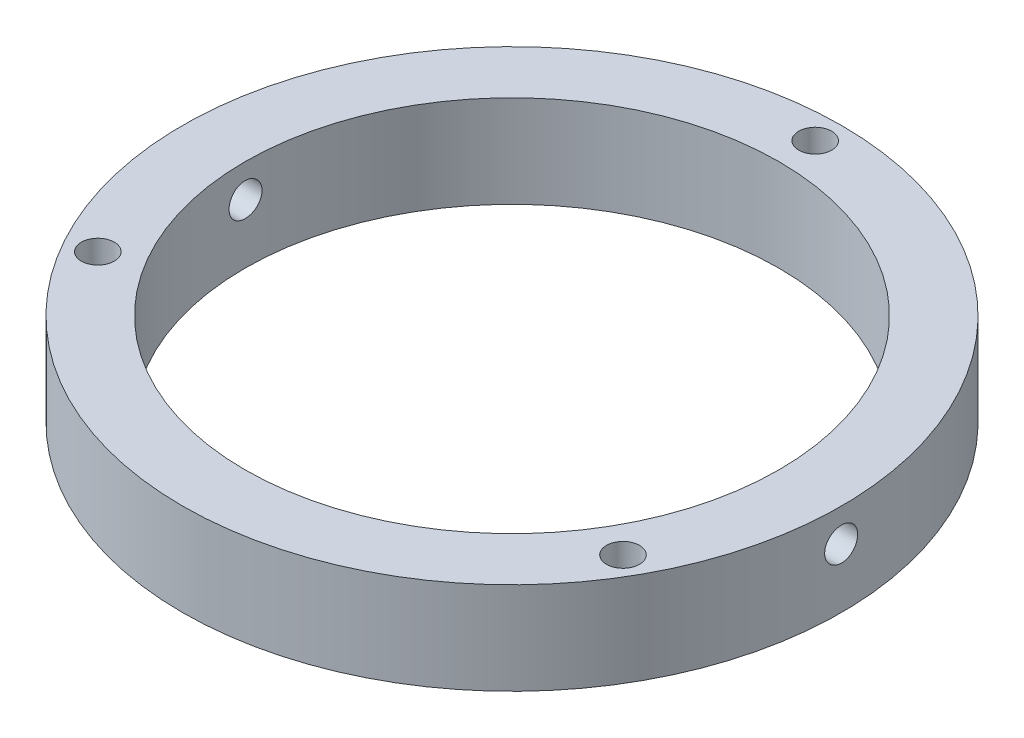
ISO-10303-21;
HEADER;
FILE_DESCRIPTION(('STEP AP214'),'2;1');
FILE_NAME('part.step','',(''),(''),'','','');
FILE_SCHEMA(('AUTOMOTIVE_DESIGN { 1 0 10303 214 1 1 1 1 }'));
ENDSEC;
DATA;
#1=APPLICATION_CONTEXT('core data for automotive mechanical design processes');
#2=APPLICATION_PROTOCOL_DEFINITION('international standard','automotive_design',2000,#1);
#3=PRODUCT_CONTEXT('',#1,'mechanical');
#4=PRODUCT('Part','Part','',(#3));
#5=PRODUCT_RELATED_PRODUCT_CATEGORY('part','',(#4));
#6=PRODUCT_DEFINITION_FORMATION('','',#4);
#7=PRODUCT_DEFINITION_CONTEXT('part definition',#1,'design');
#8=PRODUCT_DEFINITION('design','',#6,#7);
#9=PRODUCT_DEFINITION_SHAPE('','',#8);
#10=(LENGTH_UNIT() NAMED_UNIT(*) SI_UNIT(.MILLI.,.METRE.));
#11=(NAMED_UNIT(*) PLANE_ANGLE_UNIT() SI_UNIT($,.RADIAN.));
#12=(NAMED_UNIT(*) SI_UNIT($,.STERADIAN.) SOLID_ANGLE_UNIT());
#13=UNCERTAINTY_MEASURE_WITH_UNIT(LENGTH_MEASURE(1.E-05),#10,'distance_accuracy_value','');
#14=(GEOMETRIC_REPRESENTATION_CONTEXT(3) GLOBAL_UNCERTAINTY_ASSIGNED_CONTEXT((#13)) GLOBAL_UNIT_ASSIGNED_CONTEXT((#10,
#11,#12)) REPRESENTATION_CONTEXT('',''));
#15=CARTESIAN_POINT('',(0.,0.,0.));
#16=DIRECTION('',(0.,0.,1.));
#17=DIRECTION('',(1.,0.,0.));
#18=AXIS2_PLACEMENT_3D('',#15,#16,#17);
#19=CARTESIAN_POINT('',(0.,7.00000000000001,0.));
#20=DIRECTION('',(0.,-1.,0.));
#21=DIRECTION('',(0.,0.,-1.));
#22=AXIS2_PLACEMENT_3D('',#19,#20,#21);
#23=CYLINDRICAL_SURFACE('',#22,25.);
#24=CARTESIAN_POINT('',(-25.,3.25000000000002,0.));
#25=CARTESIAN_POINT('',(-24.9999995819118,3.25000309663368,-0.0701660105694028));
#26=CARTESIAN_POINT('',(-24.9997014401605,3.2559277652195,-0.140381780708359));
#27=CARTESIAN_POINT('',(-24.9985407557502,3.27947842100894,-0.278876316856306));
#28=CARTESIAN_POINT('',(-24.9976775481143,3.29711819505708,-0.347152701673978));
#29=CARTESIAN_POINT('',(-24.995484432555,3.34359275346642,-0.479742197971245));
#30=CARTESIAN_POINT('',(-24.9941547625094,3.37242183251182,-0.54405730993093));
#31=CARTESIAN_POINT('',(-24.9911784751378,3.44044788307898,-0.666917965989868));
#32=CARTESIAN_POINT('',(-24.9895319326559,3.47964240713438,-0.725464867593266));
#33=CARTESIAN_POINT('',(-24.9861052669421,3.56733084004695,-0.835203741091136));
#34=CARTESIAN_POINT('',(-24.9843250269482,3.61583293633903,-0.886389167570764));
#35=CARTESIAN_POINT('',(-24.9808326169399,3.72074337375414,-0.979896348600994));
#36=CARTESIAN_POINT('',(-24.9791204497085,3.77715203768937,-1.02221774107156));
#37=CARTESIAN_POINT('',(-24.9759564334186,3.89630870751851,-1.09681354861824));
#38=CARTESIAN_POINT('',(-24.974504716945,3.95905991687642,-1.12908285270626));
#39=CARTESIAN_POINT('',(-24.9720267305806,4.08909785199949,-1.18262568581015));
#40=CARTESIAN_POINT('',(-24.9710004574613,4.15638454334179,-1.20389929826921));
#41=CARTESIAN_POINT('',(-24.9694901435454,4.2935232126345,-1.23482957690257));
#42=CARTESIAN_POINT('',(-24.969005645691,4.36337297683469,-1.24449603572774));
#43=CARTESIAN_POINT('',(-24.9686321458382,4.50370528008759,-1.25196782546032));
#44=CARTESIAN_POINT('',(-24.9687431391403,4.57418781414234,-1.24977324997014));
#45=CARTESIAN_POINT('',(-24.9695476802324,4.71371835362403,-1.23359342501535));
#46=CARTESIAN_POINT('',(-24.9702407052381,4.78276758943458,-1.21961875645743));
#47=CARTESIAN_POINT('',(-24.9721303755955,4.91753889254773,-1.18029183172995));
#48=CARTESIAN_POINT('',(-24.9733270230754,4.98326094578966,-1.15493952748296));
#49=CARTESIAN_POINT('',(-24.9760896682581,5.10954636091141,-1.09356490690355));
#50=CARTESIAN_POINT('',(-24.9776558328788,5.17010737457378,-1.0575377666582));
#51=CARTESIAN_POINT('',(-24.9809808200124,5.28432592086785,-0.975839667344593));
#52=CARTESIAN_POINT('',(-24.9827396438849,5.33798340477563,-0.930168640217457));
#53=CARTESIAN_POINT('',(-24.9862540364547,5.43693333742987,-0.830419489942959));
#54=CARTESIAN_POINT('',(-24.9880095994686,5.48221655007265,-0.776332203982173));
#55=CARTESIAN_POINT('',(-24.9913177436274,5.56306134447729,-0.66131807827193));
#56=CARTESIAN_POINT('',(-24.9928703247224,5.59862292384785,-0.600391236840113));
#57=CARTESIAN_POINT('',(-24.995597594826,5.65901410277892,-0.473422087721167));
#58=CARTESIAN_POINT('',(-24.9967722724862,5.68384338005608,-0.407379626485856));
#59=CARTESIAN_POINT('',(-24.9986111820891,5.72205910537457,-0.272056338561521));
#60=CARTESIAN_POINT('',(-24.9992754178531,5.73544563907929,-0.202775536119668));
#61=CARTESIAN_POINT('',(-25.0000180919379,5.75038449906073,-0.0630223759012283));
#62=CARTESIAN_POINT('',(-25.0000971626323,5.75194960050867,0.00744861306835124));
#63=CARTESIAN_POINT('',(-24.9996622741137,5.74323450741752,0.14765221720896));
#64=CARTESIAN_POINT('',(-24.9991483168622,5.73295435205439,0.217384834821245));
#65=CARTESIAN_POINT('',(-24.9975856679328,5.70085113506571,0.354096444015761));
#66=CARTESIAN_POINT('',(-24.9965372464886,5.67903390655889,0.421076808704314));
#67=CARTESIAN_POINT('',(-24.9940237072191,5.62448176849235,0.550424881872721));
#68=CARTESIAN_POINT('',(-24.9925585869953,5.59174679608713,0.61279256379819));
#69=CARTESIAN_POINT('',(-24.9893748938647,5.51625568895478,0.73120353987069));
#70=CARTESIAN_POINT('',(-24.9876561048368,5.47349099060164,0.787241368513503));
#71=CARTESIAN_POINT('',(-24.9841593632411,5.3791668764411,0.891346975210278));
#72=CARTESIAN_POINT('',(-24.9823814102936,5.32760740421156,0.939414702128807));
#73=CARTESIAN_POINT('',(-24.9789649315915,5.21710236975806,1.0262586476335));
#74=CARTESIAN_POINT('',(-24.9773265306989,5.15815030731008,1.06502660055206));
#75=CARTESIAN_POINT('',(-24.9743758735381,5.03456637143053,1.13211402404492));
#76=CARTESIAN_POINT('',(-24.9730636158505,4.96993452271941,1.16043354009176));
#77=CARTESIAN_POINT('',(-24.970914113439,4.83685629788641,1.20580579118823));
#78=CARTESIAN_POINT('',(-24.9700766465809,4.76841172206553,1.22286379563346));
#79=CARTESIAN_POINT('',(-24.9689705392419,4.6296257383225,1.24524604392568));
#80=CARTESIAN_POINT('',(-24.9687018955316,4.55928434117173,1.25057035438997));
#81=CARTESIAN_POINT('',(-24.9687638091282,4.41878373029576,1.24933344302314));
#82=CARTESIAN_POINT('',(-24.9690937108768,4.34862440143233,1.24278522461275));
#83=CARTESIAN_POINT('',(-24.9703141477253,4.21040251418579,1.21801601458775));
#84=CARTESIAN_POINT('',(-24.9712046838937,4.14233995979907,1.19979500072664));
#85=CARTESIAN_POINT('',(-24.97344587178,4.01024094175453,1.1522000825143));
#86=CARTESIAN_POINT('',(-24.9747965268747,3.94620450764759,1.12282609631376));
#87=CARTESIAN_POINT('',(-24.9778056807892,3.82397139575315,1.05376129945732));
#88=CARTESIAN_POINT('',(-24.9794641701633,3.76577453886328,1.01407080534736));
#89=CARTESIAN_POINT('',(-24.9829041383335,3.65680763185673,0.925453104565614));
#90=CARTESIAN_POINT('',(-24.9846857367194,3.60604495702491,0.876516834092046));
#91=CARTESIAN_POINT('',(-24.9881702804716,3.51343955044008,0.77080264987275));
#92=CARTESIAN_POINT('',(-24.9898732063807,3.47159901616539,0.714022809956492));
#93=CARTESIAN_POINT('',(-24.9930096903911,3.39800602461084,0.594188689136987));
#94=CARTESIAN_POINT('',(-24.9944429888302,3.36626327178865,0.531128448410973));
#95=CARTESIAN_POINT('',(-24.9968748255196,3.3138538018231,0.400613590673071));
#96=CARTESIAN_POINT('',(-24.9978738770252,3.29317400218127,0.333164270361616));
#97=CARTESIAN_POINT('',(-24.9990604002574,3.26890181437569,0.221079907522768));
#98=CARTESIAN_POINT('',(-24.9994112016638,3.26182268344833,0.177170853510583));
#99=CARTESIAN_POINT('',(-24.9998811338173,3.25237079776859,0.0888478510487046));
#100=CARTESIAN_POINT('',(-25.000000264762,3.2499980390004,0.0444339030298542));
#101=CARTESIAN_POINT('',(-25.,3.25000000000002,0.));
#102=B_SPLINE_CURVE_WITH_KNOTS('',3,(#24,#25,#26,#27,#28,#29,#30,#31,#32,#33,#34,#35,#36,#37,
#38,#39,#40,#41,#42,#43,#44,#45,#46,#47,#48,#49,#50,#51,#52,#53,#54,#55,#56,#57,#58,#59,#60,#61,
#62,#63,#64,#65,#66,#67,#68,#69,#70,#71,#72,#73,#74,#75,#76,#77,#78,#79,#80,#81,#82,#83,#84,#85,
#86,#87,#88,#89,#90,#91,#92,#93,#94,#95,#96,#97,#98,#99,#100,#101),.UNSPECIFIED.,.T.,.F.,(4,2,2,
2,2,2,2,2,2,2,2,2,2,2,2,2,2,2,2,2,2,2,2,2,2,2,2,2,2,2,2,2,2,2,2,2,2,2,4),(0.,0.210335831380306,
0.420919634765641,0.631396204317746,0.841823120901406,1.0524359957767,1.2630574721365,
1.47378586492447,1.68451265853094,1.895061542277,2.10560876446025,2.31596707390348,
2.52632627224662,2.73678067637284,2.94723656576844,3.15792320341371,3.36860989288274,
3.5793029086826,3.7899943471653,4.00045806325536,4.21092108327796,4.42127779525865,
4.6316357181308,4.84217390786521,5.05271344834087,5.26343942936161,5.47416449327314,
5.68479088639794,5.89541608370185,6.10581073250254,6.3162057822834,6.52660237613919,
6.73699251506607,6.94758998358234,7.15823926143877,7.36909037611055,7.57969159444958,
7.71289070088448,7.84608969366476),.UNSPECIFIED.);
#103=CARTESIAN_POINT('',(-25.,3.25000000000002,0.));
#104=VERTEX_POINT('',#103);
#105=EDGE_CURVE('E12',#104,#104,#102,.T.);
#106=ORIENTED_EDGE('',*,*,#105,.T.);
#107=EDGE_LOOP('',(#106));
#108=FACE_BOUND('',#107,.T.);
#109=CARTESIAN_POINT('',(24.9687304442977,4.5,-1.24999999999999));
#110=CARTESIAN_POINT('',(24.9687308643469,4.42983405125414,-1.24999690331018));
#111=CARTESIAN_POINT('',(24.96902938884,4.35961834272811,-1.24407224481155));
#112=CARTESIAN_POINT('',(24.9701914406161,4.22112393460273,-1.22052163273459));
#113=CARTESIAN_POINT('',(24.9710556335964,4.15284761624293,-1.20288189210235));
#114=CARTESIAN_POINT('',(24.9732508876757,4.02025826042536,-1.15640743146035));
#115=CARTESIAN_POINT('',(24.974581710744,3.95594322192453,-1.12757841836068));
#116=CARTESIAN_POINT('',(24.9775599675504,3.83308268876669,-1.05955252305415));
#117=CARTESIAN_POINT('',(24.9792073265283,3.77453583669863,-1.02035808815));
#118=CARTESIAN_POINT('',(24.9826349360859,3.66479690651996,-0.932669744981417));
#119=CARTESIAN_POINT('',(24.9844153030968,3.61361138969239,-0.884167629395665));
#120=CARTESIAN_POINT('',(24.9879072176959,3.52010403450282,-0.779257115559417));
#121=CARTESIAN_POINT('',(24.9896187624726,3.4777825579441,-0.722848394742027));
#122=CARTESIAN_POINT('',(24.9927810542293,3.40318666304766,-0.603691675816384));
#123=CARTESIAN_POINT('',(24.9942316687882,3.37091734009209,-0.540940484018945));
#124=CARTESIAN_POINT('',(24.9967074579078,3.3173744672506,-0.410902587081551));
#125=CARTESIAN_POINT('',(24.9977326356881,3.2961008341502,-0.343615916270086));
#126=CARTESIAN_POINT('',(24.9992412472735,3.26517051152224,-0.206477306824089));
#127=CARTESIAN_POINT('',(24.9997251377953,3.25550402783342,-0.136627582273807));
#128=CARTESIAN_POINT('',(25.0000981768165,3.24803217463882,0.00370464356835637));
#129=CARTESIAN_POINT('',(24.9999873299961,3.25022671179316,0.0741871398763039));
#130=CARTESIAN_POINT('',(24.9991837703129,3.26640647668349,0.213717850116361));
#131=CARTESIAN_POINT('',(24.9984915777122,3.28038116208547,0.282767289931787));
#132=CARTESIAN_POINT('',(24.9966038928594,3.31970819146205,0.417538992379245));
#133=CARTESIAN_POINT('',(24.9954083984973,3.34506058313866,0.483261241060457));
#134=CARTESIAN_POINT('',(24.9926478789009,3.40643538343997,0.609546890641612));
#135=CARTESIAN_POINT('',(24.9910826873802,3.4424625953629,0.670107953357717));
#136=CARTESIAN_POINT('',(24.9877590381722,3.52416084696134,0.784326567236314));
#137=CARTESIAN_POINT('',(24.9860005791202,3.56983195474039,0.837984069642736));
#138=CARTESIAN_POINT('',(24.9824861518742,3.66958116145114,0.936933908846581));
#139=CARTESIAN_POINT('',(24.9807301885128,3.72366840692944,0.982217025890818));
#140=CARTESIAN_POINT('',(24.9774206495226,3.83868241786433,1.06306164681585));
#141=CARTESIAN_POINT('',(24.9758670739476,3.89960918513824,1.09862314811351));
#142=CARTESIAN_POINT('',(24.9731376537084,4.02657831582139,1.15901427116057));
#143=CARTESIAN_POINT('',(24.9719618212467,4.09262084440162,1.1838435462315));
#144=CARTESIAN_POINT('',(24.9701209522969,4.22794427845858,1.22205924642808));
#145=CARTESIAN_POINT('',(24.9694559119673,4.29722515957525,1.23544575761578));
#146=CARTESIAN_POINT('',(24.9687123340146,4.43697835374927,1.25038453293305));
#147=CARTESIAN_POINT('',(24.9686331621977,4.50744929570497,1.25194959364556));
#148=CARTESIAN_POINT('',(24.9690685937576,4.64765279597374,1.24323443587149));
#149=CARTESIAN_POINT('',(24.9695831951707,4.71738535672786,1.23295425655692));
#150=CARTESIAN_POINT('',(24.9711475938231,4.85409669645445,1.20085104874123));
#151=CARTESIAN_POINT('',(24.9721971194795,4.92107685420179,1.17903387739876));
#152=CARTESIAN_POINT('',(24.9747128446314,5.05042453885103,1.1244819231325));
#153=CARTESIAN_POINT('',(24.9761790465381,5.11279203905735,1.09174707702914));
#154=CARTESIAN_POINT('',(24.9793644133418,5.23120289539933,1.01625615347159));
#155=CARTESIAN_POINT('',(24.9810837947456,5.2872407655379,0.973491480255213));
#156=CARTESIAN_POINT('',(24.9845809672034,5.3913464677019,0.879167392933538));
#157=CARTESIAN_POINT('',(24.9863587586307,5.43941424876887,0.827607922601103));
#158=CARTESIAN_POINT('',(24.9897742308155,5.52625830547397,0.717102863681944));
#159=CARTESIAN_POINT('',(24.9914117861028,5.56502631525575,0.658150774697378));
#160=CARTESIAN_POINT('',(24.9943604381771,5.63211383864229,0.534566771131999));
#161=CARTESIAN_POINT('',(24.995671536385,5.66043339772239,0.469934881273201));
#162=CARTESIAN_POINT('',(24.9978189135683,5.70580567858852,0.336856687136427));
#163=CARTESIAN_POINT('',(24.9986554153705,5.72286368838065,0.268412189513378));
#164=CARTESIAN_POINT('',(24.999760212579,5.74524597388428,0.129626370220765));
#165=CARTESIAN_POINT('',(25.0000285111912,5.75057031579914,0.059285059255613));
#166=CARTESIAN_POINT('',(24.999966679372,5.74933349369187,-0.0812156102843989));
#167=CARTESIAN_POINT('',(24.9996372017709,5.74278529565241,-0.151375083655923));
#168=CARTESIAN_POINT('',(24.9984181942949,5.71801607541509,-0.289597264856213));
#169=CARTESIAN_POINT('',(24.9975286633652,5.69979503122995,-0.357659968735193));
#170=CARTESIAN_POINT('',(24.9952896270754,5.65219999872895,-0.489759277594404));
#171=CARTESIAN_POINT('',(24.9939401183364,5.62282592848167,-0.553795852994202));
#172=CARTESIAN_POINT('',(24.9909328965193,5.55376091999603,-0.6760292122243));
#173=CARTESIAN_POINT('',(24.9892751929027,5.51407029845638,-0.734226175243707));
#174=CARTESIAN_POINT('',(24.9858360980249,5.42545246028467,-0.843193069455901));
#175=CARTESIAN_POINT('',(24.9840545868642,5.37651620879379,-0.893955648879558));
#176=CARTESIAN_POINT('',(24.980569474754,5.27080210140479,-0.98656087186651));
#177=CARTESIAN_POINT('',(24.9788658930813,5.21402231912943,-1.02840131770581));
#178=CARTESIAN_POINT('',(24.9757276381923,5.09418824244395,-1.10199421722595));
#179=CARTESIAN_POINT('',(24.9742932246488,5.03112797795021,-1.13373694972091));
#180=CARTESIAN_POINT('',(24.971859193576,4.90061306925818,-1.18614637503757));
#181=CARTESIAN_POINT('',(24.9708590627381,4.83316372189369,-1.20682615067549));
#182=CARTESIAN_POINT('',(24.9696711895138,4.72107942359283,-1.23109826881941));
#183=CARTESIAN_POINT('',(24.969319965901,4.67717046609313,-1.2381773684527));
#184=CARTESIAN_POINT('',(24.9688494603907,4.58884765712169,-1.24762921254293));
#185=CARTESIAN_POINT('',(24.9687301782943,4.54443380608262,-1.25000196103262));
#186=CARTESIAN_POINT('',(24.9687304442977,4.5,-1.24999999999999));
#187=B_SPLINE_CURVE_WITH_KNOTS('',3,(#109,#110,#111,#112,#113,#114,#115,#116,#117,#118,#119,
#120,#121,#122,#123,#124,#125,#126,#127,#128,#129,#130,#131,#132,#133,#134,#135,#136,#137,#138,
#139,#140,#141,#142,#143,#144,#145,#146,#147,#148,#149,#150,#151,#152,#153,#154,#155,#156,#157,
#158,#159,#160,#161,#162,#163,#164,#165,#166,#167,#168,#169,#170,#171,#172,#173,#174,#175,#176,
#177,#178,#179,#180,#181,#182,#183,#184,#185,#186),.UNSPECIFIED.,.T.,.F.,(4,2,2,2,2,2,2,2,2,2,2,
2,2,2,2,2,2,2,2,2,2,2,2,2,2,2,2,2,2,2,2,2,2,2,2,2,2,2,4),(0.,0.210335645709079,
0.420919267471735,0.631395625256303,0.841822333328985,1.05243545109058,1.26305716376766,
1.47378546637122,1.68451217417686,1.89506094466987,2.10560805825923,2.31596694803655,
2.52632671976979,2.73678129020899,2.94723734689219,3.15792374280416,3.36861019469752,
3.57930345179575,3.78999512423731,4.00045869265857,4.21092156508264,4.42127769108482,
4.63163503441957,4.84217332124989,5.05271295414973,5.26343903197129,5.47416419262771,
5.68479033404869,5.89541528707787,6.10581035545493,6.31620582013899,6.52660283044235,
6.73699338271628,6.94759060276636,7.15823963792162,7.36909085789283,7.57969217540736,
7.71289099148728,7.84608969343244),.UNSPECIFIED.);
#188=CARTESIAN_POINT('',(24.9687304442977,4.5,-1.24999999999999));
#189=VERTEX_POINT('',#188);
#190=EDGE_CURVE('E61',#189,#189,#187,.T.);
#191=ORIENTED_EDGE('',*,*,#190,.T.);
#192=EDGE_LOOP('',(#191));
#193=FACE_BOUND('',#192,.T.);
#194=CARTESIAN_POINT('',(0.,7.00000000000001,0.));
#195=DIRECTION('',(0.,1.,0.));
#196=DIRECTION('',(0.,0.,1.));
#197=AXIS2_PLACEMENT_3D('',#194,#195,#196);
#198=CIRCLE('',#197,25.);
#199=CARTESIAN_POINT('',(0.,7.00000000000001,25.));
#200=VERTEX_POINT('',#199);
#201=EDGE_CURVE('E68',#200,#200,#198,.T.);
#202=ORIENTED_EDGE('',*,*,#201,.F.);
#203=EDGE_LOOP('',(#202));
#204=FACE_BOUND('',#203,.T.);
#205=CARTESIAN_POINT('',(0.,0.,0.));
#206=DIRECTION('',(0.,1.,0.));
#207=DIRECTION('',(0.,0.,1.));
#208=AXIS2_PLACEMENT_3D('',#205,#206,#207);
#209=CIRCLE('',#208,25.);
#210=CARTESIAN_POINT('',(0.,0.,25.));
#211=VERTEX_POINT('',#210);
#212=EDGE_CURVE('E74',#211,#211,#209,.T.);
#213=ORIENTED_EDGE('',*,*,#212,.T.);
#214=EDGE_LOOP('',(#213));
#215=FACE_BOUND('',#214,.T.);
#216=ADVANCED_FACE('F50',(#108,#193,#204,#215),#23,.T.);
#217=CARTESIAN_POINT('',(0.,7.00000000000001,0.));
#218=DIRECTION('',(0.,1.,0.));
#219=DIRECTION('',(0.,0.,1.));
#220=AXIS2_PLACEMENT_3D('',#217,#218,#219);
#221=PLANE('',#220);
#222=CARTESIAN_POINT('',(0.,7.00000000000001,-23.));
#223=DIRECTION('',(0.,1.,0.));
#224=DIRECTION('',(0.,0.,1.));
#225=AXIS2_PLACEMENT_3D('',#222,#223,#224);
#226=CIRCLE('',#225,1.24999999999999);
#227=CARTESIAN_POINT('',(0.,7.00000000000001,-21.75));
#228=VERTEX_POINT('',#227);
#229=EDGE_CURVE('E161',#228,#228,#226,.T.);
#230=ORIENTED_EDGE('',*,*,#229,.F.);
#231=EDGE_LOOP('',(#230));
#232=FACE_BOUND('',#231,.T.);
#233=CARTESIAN_POINT('',(-19.9185842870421,7.00000000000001,11.5));
#234=DIRECTION('',(0.,1.,0.));
#235=DIRECTION('',(0.,0.,1.));
#236=AXIS2_PLACEMENT_3D('',#233,#234,#235);
#237=CIRCLE('',#236,1.24999999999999);
#238=CARTESIAN_POINT('',(-19.9185842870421,7.00000000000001,12.75));
#239=VERTEX_POINT('',#238);
#240=EDGE_CURVE('E155',#239,#239,#237,.T.);
#241=ORIENTED_EDGE('',*,*,#240,.F.);
#242=EDGE_LOOP('',(#241));
#243=FACE_BOUND('',#242,.T.);
#244=CARTESIAN_POINT('',(19.9185842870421,6.99999999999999,11.5));
#245=DIRECTION('',(0.,1.,0.));
#246=DIRECTION('',(0.,0.,1.));
#247=AXIS2_PLACEMENT_3D('',#244,#245,#246);
#248=CIRCLE('',#247,1.24999999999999);
#249=CARTESIAN_POINT('',(19.9185842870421,6.99999999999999,12.7499999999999));
#250=VERTEX_POINT('',#249);
#251=EDGE_CURVE('E147',#250,#250,#248,.T.);
#252=ORIENTED_EDGE('',*,*,#251,.F.);
#253=EDGE_LOOP('',(#252));
#254=FACE_BOUND('',#253,.T.);
#255=CARTESIAN_POINT('',(0.,7.00000000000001,0.));
#256=DIRECTION('',(0.,1.,0.));
#257=DIRECTION('',(0.,0.,1.));
#258=AXIS2_PLACEMENT_3D('',#255,#256,#257);
#259=CIRCLE('',#258,20.25);
#260=CARTESIAN_POINT('',(0.,7.00000000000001,20.25));
#261=VERTEX_POINT('',#260);
#262=EDGE_CURVE('E134',#261,#261,#259,.T.);
#263=ORIENTED_EDGE('',*,*,#262,.F.);
#264=EDGE_LOOP('',(#263));
#265=FACE_BOUND('',#264,.T.);
#266=ORIENTED_EDGE('',*,*,#201,.T.);
#267=EDGE_LOOP('',(#266));
#268=FACE_BOUND('',#267,.T.);
#269=ADVANCED_FACE('F110',(#232,#243,#254,#265,#268),#221,.T.);
#270=CARTESIAN_POINT('',(0.,0.,0.));
#271=DIRECTION('',(0.,1.,0.));
#272=DIRECTION('',(0.,0.,1.));
#273=AXIS2_PLACEMENT_3D('',#270,#271,#272);
#274=PLANE('',#273);
#275=CARTESIAN_POINT('',(0.,0.,-23.));
#276=DIRECTION('',(0.,1.,0.));
#277=DIRECTION('',(0.,0.,1.));
#278=AXIS2_PLACEMENT_3D('',#275,#276,#277);
#279=CIRCLE('',#278,1.25);
#280=CARTESIAN_POINT('',(0.,0.,-21.75));
#281=VERTEX_POINT('',#280);
#282=EDGE_CURVE('E159',#281,#281,#279,.T.);
#283=ORIENTED_EDGE('',*,*,#282,.T.);
#284=EDGE_LOOP('',(#283));
#285=FACE_BOUND('',#284,.T.);
#286=CARTESIAN_POINT('',(-19.9185842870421,0.,11.5));
#287=DIRECTION('',(0.,1.,0.));
#288=DIRECTION('',(0.,0.,1.));
#289=AXIS2_PLACEMENT_3D('',#286,#287,#288);
#290=CIRCLE('',#289,1.25);
#291=CARTESIAN_POINT('',(-19.9185842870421,0.,12.75));
#292=VERTEX_POINT('',#291);
#293=EDGE_CURVE('E151',#292,#292,#290,.T.);
#294=ORIENTED_EDGE('',*,*,#293,.T.);
#295=EDGE_LOOP('',(#294));
#296=FACE_BOUND('',#295,.T.);
#297=CARTESIAN_POINT('',(19.9185842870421,0.,11.5));
#298=DIRECTION('',(0.,1.,0.));
#299=DIRECTION('',(0.,0.,1.));
#300=AXIS2_PLACEMENT_3D('',#297,#298,#299);
#301=CIRCLE('',#300,1.25);
#302=CARTESIAN_POINT('',(19.9185842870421,0.,12.75));
#303=VERTEX_POINT('',#302);
#304=EDGE_CURVE('E141',#303,#303,#301,.T.);
#305=ORIENTED_EDGE('',*,*,#304,.T.);
#306=EDGE_LOOP('',(#305));
#307=FACE_BOUND('',#306,.T.);
#308=CARTESIAN_POINT('',(0.,0.,0.));
#309=DIRECTION('',(0.,1.,0.));
#310=DIRECTION('',(0.,0.,1.));
#311=AXIS2_PLACEMENT_3D('',#308,#309,#310);
#312=CIRCLE('',#311,20.25);
#313=CARTESIAN_POINT('',(0.,0.,20.25));
#314=VERTEX_POINT('',#313);
#315=EDGE_CURVE('E130',#314,#314,#312,.T.);
#316=ORIENTED_EDGE('',*,*,#315,.T.);
#317=EDGE_LOOP('',(#316));
#318=FACE_BOUND('',#317,.T.);
#319=ORIENTED_EDGE('',*,*,#212,.F.);
#320=EDGE_LOOP('',(#319));
#321=FACE_BOUND('',#320,.T.);
#322=ADVANCED_FACE('F108',(#285,#296,#307,#318,#321),#274,.F.);
#323=CARTESIAN_POINT('',(0.,0.,0.));
#324=DIRECTION('',(0.,1.,0.));
#325=DIRECTION('',(0.,0.,1.));
#326=AXIS2_PLACEMENT_3D('',#323,#324,#325);
#327=CYLINDRICAL_SURFACE('',#326,20.25);
#328=CARTESIAN_POINT('',(-20.2113829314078,4.5,-1.24999999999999));
#329=CARTESIAN_POINT('',(-20.2113834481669,4.42985875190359,-1.24999691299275));
#330=CARTESIAN_POINT('',(-20.2117519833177,4.3596683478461,-1.24407640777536));
#331=CARTESIAN_POINT('',(-20.2131864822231,4.22122554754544,-1.22054325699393));
#332=CARTESIAN_POINT('',(-20.2142532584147,4.15297550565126,-1.20291699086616));
#333=CARTESIAN_POINT('',(-20.2169629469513,4.02043883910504,-1.15648042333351));
#334=CARTESIAN_POINT('',(-20.2186055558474,3.95615014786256,-1.12767601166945));
#335=CARTESIAN_POINT('',(-20.2222814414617,3.83333709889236,-1.05971029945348));
#336=CARTESIAN_POINT('',(-20.2243146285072,3.77481142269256,-1.02055137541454));
#337=CARTESIAN_POINT('',(-20.228545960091,3.66508286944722,-0.9329250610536));
#338=CARTESIAN_POINT('',(-20.2307443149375,3.61388957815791,-0.884445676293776));
#339=CARTESIAN_POINT('',(-20.235056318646,3.52036099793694,-0.779579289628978));
#340=CARTESIAN_POINT('',(-20.237169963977,3.47802607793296,-0.723191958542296));
#341=CARTESIAN_POINT('',(-20.2410761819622,3.40338687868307,-0.604056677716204));
#342=CARTESIAN_POINT('',(-20.2428685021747,3.37109047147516,-0.541303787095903));
#343=CARTESIAN_POINT('',(-20.2459279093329,3.31749549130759,-0.411253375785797));
#344=CARTESIAN_POINT('',(-20.2471950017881,3.29619680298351,-0.343955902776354));
#345=CARTESIAN_POINT('',(-20.249059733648,3.26522828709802,-0.206818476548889));
#346=CARTESIAN_POINT('',(-20.2496582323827,3.25554353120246,-0.136981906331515));
#347=CARTESIAN_POINT('',(-20.2501212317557,3.24803169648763,0.00332803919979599));
#348=CARTESIAN_POINT('',(-20.2499857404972,3.25020448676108,0.0738014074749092));
#349=CARTESIAN_POINT('',(-20.2489967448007,3.26633374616,0.213283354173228));
#350=CARTESIAN_POINT('',(-20.2481442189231,3.28027415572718,0.282293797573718));
#351=CARTESIAN_POINT('',(-20.2458182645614,3.31951801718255,0.416993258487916));
#352=CARTESIAN_POINT('',(-20.2443448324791,3.34482153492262,0.482682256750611));
#353=CARTESIAN_POINT('',(-20.2409412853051,3.4060915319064,0.608925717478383));
#354=CARTESIAN_POINT('',(-20.239010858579,3.44206529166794,0.66947663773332));
#355=CARTESIAN_POINT('',(-20.2349105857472,3.5236493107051,0.783686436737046));
#356=CARTESIAN_POINT('',(-20.2327407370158,3.56925967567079,0.83734523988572));
#357=CARTESIAN_POINT('',(-20.2284015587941,3.66891290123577,0.936341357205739));
#358=CARTESIAN_POINT('',(-20.2262322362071,3.7229697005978,0.981664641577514));
#359=CARTESIAN_POINT('',(-20.2221422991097,3.83793247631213,1.06259499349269));
#360=CARTESIAN_POINT('',(-20.2202216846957,3.8988384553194,1.09820205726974));
#361=CARTESIAN_POINT('',(-20.2168460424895,4.02577957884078,1.15868819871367));
#362=CARTESIAN_POINT('',(-20.2153910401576,4.09181500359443,1.18356668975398));
#363=CARTESIAN_POINT('',(-20.2131116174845,4.227136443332,1.22187981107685));
#364=CARTESIAN_POINT('',(-20.2122871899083,4.29642242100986,1.23531457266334));
#365=CARTESIAN_POINT('',(-20.2113632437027,4.43615582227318,1.25034140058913));
#366=CARTESIAN_POINT('',(-20.2112625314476,4.50660114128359,1.25195296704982));
#367=CARTESIAN_POINT('',(-20.2117942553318,4.64676110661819,1.24333860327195));
#368=CARTESIAN_POINT('',(-20.2124266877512,4.71647575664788,1.23311273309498));
#369=CARTESIAN_POINT('',(-20.2143523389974,4.85314032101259,1.20112996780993));
#370=CARTESIAN_POINT('',(-20.215645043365,4.92009234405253,1.17938204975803));
#371=CARTESIAN_POINT('',(-20.2187451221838,5.04939620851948,1.12498162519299));
#372=CARTESIAN_POINT('',(-20.2205525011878,5.11174800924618,1.0923290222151));
#373=CARTESIAN_POINT('',(-20.2244811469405,5.23017107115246,1.01699627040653));
#374=CARTESIAN_POINT('',(-20.2266028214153,5.28623400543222,0.974303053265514));
#375=CARTESIAN_POINT('',(-20.2309195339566,5.39040403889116,0.880120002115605));
#376=CARTESIAN_POINT('',(-20.2331145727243,5.43851106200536,0.828630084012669));
#377=CARTESIAN_POINT('',(-20.2373341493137,5.52546953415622,0.718231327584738));
#378=CARTESIAN_POINT('',(-20.2393584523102,5.56430836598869,0.659312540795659));
#379=CARTESIAN_POINT('',(-20.2430050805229,5.63154162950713,0.53577858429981));
#380=CARTESIAN_POINT('',(-20.244627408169,5.65993612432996,0.471163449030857));
#381=CARTESIAN_POINT('',(-20.2472861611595,5.70545274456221,0.338117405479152));
#382=CARTESIAN_POINT('',(-20.2483230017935,5.72258286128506,0.269689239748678));
#383=CARTESIAN_POINT('',(-20.2496956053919,5.74511061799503,0.130921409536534));
#384=CARTESIAN_POINT('',(-20.2500313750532,5.75050837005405,0.0605817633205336));
#385=CARTESIAN_POINT('',(-20.2499640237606,5.74941708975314,-0.0798874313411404));
#386=CARTESIAN_POINT('',(-20.2495621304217,5.74294780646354,-0.150017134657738));
#387=CARTESIAN_POINT('',(-20.2480670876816,5.71834703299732,-0.288192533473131));
#388=CARTESIAN_POINT('',(-20.2469739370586,5.70021552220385,-0.356238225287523));
#389=CARTESIAN_POINT('',(-20.2442192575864,5.65280940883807,-0.488317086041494));
#390=CARTESIAN_POINT('',(-20.2425577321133,5.62353487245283,-0.552350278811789));
#391=CARTESIAN_POINT('',(-20.2388528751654,5.5546764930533,-0.674595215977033));
#392=CARTESIAN_POINT('',(-20.2368095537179,5.51509292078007,-0.732807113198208));
#393=CARTESIAN_POINT('',(-20.2325669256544,5.42666726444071,-0.841857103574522));
#394=CARTESIAN_POINT('',(-20.2303673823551,5.37781093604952,-0.892683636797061));
#395=CARTESIAN_POINT('',(-20.2260620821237,5.27224512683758,-0.985431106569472));
#396=CARTESIAN_POINT('',(-20.2239563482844,5.2155337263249,-1.02734985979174));
#397=CARTESIAN_POINT('',(-20.2200742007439,5.09580415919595,-1.10112211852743));
#398=CARTESIAN_POINT('',(-20.218298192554,5.0327783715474,-1.13296326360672));
#399=CARTESIAN_POINT('',(-20.2152817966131,4.90231025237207,-1.18557275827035));
#400=CARTESIAN_POINT('',(-20.2140407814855,4.8348732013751,-1.20635408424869));
#401=CARTESIAN_POINT('',(-20.2125603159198,4.72251927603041,-1.23084937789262));
#402=CARTESIAN_POINT('',(-20.2121207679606,4.67832876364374,-1.2380215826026));
#403=CARTESIAN_POINT('',(-20.2115319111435,4.5894321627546,-1.24759787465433));
#404=CARTESIAN_POINT('',(-20.2113826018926,4.54472607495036,-1.25000196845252));
#405=CARTESIAN_POINT('',(-20.2113829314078,4.5,-1.24999999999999));
#406=B_SPLINE_CURVE_WITH_KNOTS('',3,(#328,#329,#330,#331,#332,#333,#334,#335,#336,#337,#338,
#339,#340,#341,#342,#343,#344,#345,#346,#347,#348,#349,#350,#351,#352,#353,#354,#355,#356,#357,
#358,#359,#360,#361,#362,#363,#364,#365,#366,#367,#368,#369,#370,#371,#372,#373,#374,#375,#376,
#377,#378,#379,#380,#381,#382,#383,#384,#385,#386,#387,#388,#389,#390,#391,#392,#393,#394,#395,
#396,#397,#398,#399,#400,#401,#402,#403,#404,#405),.UNSPECIFIED.,.T.,.F.,(4,2,2,2,2,2,2,2,2,2,2,
2,2,2,2,2,2,2,2,2,2,2,2,2,2,2,2,2,2,2,2,2,2,2,2,2,2,2,4),(0.,0.210260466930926,
0.420766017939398,0.631160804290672,0.841507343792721,1.0521264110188,1.26275424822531,
1.47354684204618,1.68433722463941,1.89485636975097,2.10537319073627,2.31560317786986,
2.52583438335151,2.73620936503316,2.94658665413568,3.15731485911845,3.3680431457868,
3.57878295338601,3.78952034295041,3.99991008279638,4.21029875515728,4.4205237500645,
4.63075060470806,4.8412526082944,5.0517566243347,5.26254559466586,5.47333329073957,
5.68397128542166,5.89460726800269,6.10489302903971,6.31517916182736,6.52546404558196,
6.73574340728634,6.94634844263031,7.15700503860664,7.36791901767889,7.57858498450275,
7.71265927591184,7.8467333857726),.UNSPECIFIED.);
#407=CARTESIAN_POINT('',(-20.2113829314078,4.5,-1.24999999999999));
#408=VERTEX_POINT('',#407);
#409=EDGE_CURVE('E98',#408,#408,#406,.T.);
#410=ORIENTED_EDGE('',*,*,#409,.T.);
#411=EDGE_LOOP('',(#410));
#412=FACE_BOUND('',#411,.T.);
#413=CARTESIAN_POINT('',(20.2113829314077,4.5,-1.24999999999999));
#414=CARTESIAN_POINT('',(20.2113834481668,4.57014124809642,-1.24999691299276));
#415=CARTESIAN_POINT('',(20.2117519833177,4.64033165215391,-1.24407640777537));
#416=CARTESIAN_POINT('',(20.2131864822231,4.77877445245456,-1.22054325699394));
#417=CARTESIAN_POINT('',(20.2142532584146,4.84702449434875,-1.20291699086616));
#418=CARTESIAN_POINT('',(20.2169629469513,4.97956116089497,-1.15648042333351));
#419=CARTESIAN_POINT('',(20.2186055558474,5.04384985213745,-1.12767601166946));
#420=CARTESIAN_POINT('',(20.2222814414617,5.16666290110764,-1.05971029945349));
#421=CARTESIAN_POINT('',(20.2243146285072,5.22518857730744,-1.02055137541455));
#422=CARTESIAN_POINT('',(20.228545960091,5.33491713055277,-0.932925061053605));
#423=CARTESIAN_POINT('',(20.2307443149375,5.3861104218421,-0.884445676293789));
#424=CARTESIAN_POINT('',(20.235056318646,5.47963900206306,-0.779579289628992));
#425=CARTESIAN_POINT('',(20.237169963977,5.52197392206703,-0.723191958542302));
#426=CARTESIAN_POINT('',(20.2410761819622,5.59661312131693,-0.604056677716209));
#427=CARTESIAN_POINT('',(20.2428685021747,5.62890952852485,-0.541303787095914));
#428=CARTESIAN_POINT('',(20.2459279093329,5.68250450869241,-0.411253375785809));
#429=CARTESIAN_POINT('',(20.2471950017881,5.70380319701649,-0.343955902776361));
#430=CARTESIAN_POINT('',(20.249059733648,5.73477171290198,-0.206818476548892));
#431=CARTESIAN_POINT('',(20.2496582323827,5.74445646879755,-0.13698190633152));
#432=CARTESIAN_POINT('',(20.2501212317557,5.75196830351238,0.00332803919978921));
#433=CARTESIAN_POINT('',(20.2499857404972,5.74979551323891,0.0738014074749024));
#434=CARTESIAN_POINT('',(20.2489967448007,5.73366625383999,0.213283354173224));
#435=CARTESIAN_POINT('',(20.2481442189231,5.71972584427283,0.282293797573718));
#436=CARTESIAN_POINT('',(20.2458182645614,5.68048198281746,0.416993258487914));
#437=CARTESIAN_POINT('',(20.2443448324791,5.65517846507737,0.482682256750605));
#438=CARTESIAN_POINT('',(20.2409412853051,5.59390846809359,0.608925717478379));
#439=CARTESIAN_POINT('',(20.239010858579,5.55793470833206,0.669476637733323));
#440=CARTESIAN_POINT('',(20.2349105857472,5.47635068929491,0.783686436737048));
#441=CARTESIAN_POINT('',(20.2327407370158,5.43074032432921,0.837345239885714));
#442=CARTESIAN_POINT('',(20.2284015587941,5.33108709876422,0.936341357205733));
#443=CARTESIAN_POINT('',(20.2262322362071,5.2770302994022,0.981664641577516));
#444=CARTESIAN_POINT('',(20.2221422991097,5.16206752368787,1.06259499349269));
#445=CARTESIAN_POINT('',(20.2202216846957,5.10116154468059,1.09820205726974));
#446=CARTESIAN_POINT('',(20.2168460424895,4.97422042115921,1.15868819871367));
#447=CARTESIAN_POINT('',(20.2153910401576,4.90818499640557,1.18356668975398));
#448=CARTESIAN_POINT('',(20.2131116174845,4.77286355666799,1.22187981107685));
#449=CARTESIAN_POINT('',(20.2122871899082,4.70357757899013,1.23531457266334));
#450=CARTESIAN_POINT('',(20.2113632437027,4.56384417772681,1.25034140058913));
#451=CARTESIAN_POINT('',(20.2112625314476,4.4933988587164,1.25195296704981));
#452=CARTESIAN_POINT('',(20.2117942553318,4.3532388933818,1.24333860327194));
#453=CARTESIAN_POINT('',(20.2124266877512,4.28352424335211,1.23311273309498));
#454=CARTESIAN_POINT('',(20.2143523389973,4.14685967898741,1.20112996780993));
#455=CARTESIAN_POINT('',(20.215645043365,4.07990765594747,1.17938204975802));
#456=CARTESIAN_POINT('',(20.2187451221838,3.95060379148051,1.12498162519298));
#457=CARTESIAN_POINT('',(20.2205525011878,3.88825199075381,1.0923290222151));
#458=CARTESIAN_POINT('',(20.2244811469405,3.76982892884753,1.01699627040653));
#459=CARTESIAN_POINT('',(20.2266028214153,3.71376599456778,0.974303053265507));
#460=CARTESIAN_POINT('',(20.2309195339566,3.60959596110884,0.880120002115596));
#461=CARTESIAN_POINT('',(20.2331145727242,3.56148893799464,0.828630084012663));
#462=CARTESIAN_POINT('',(20.2373341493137,3.47453046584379,0.718231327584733));
#463=CARTESIAN_POINT('',(20.2393584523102,3.43569163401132,0.659312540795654));
#464=CARTESIAN_POINT('',(20.2430050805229,3.36845837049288,0.535778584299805));
#465=CARTESIAN_POINT('',(20.2446274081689,3.34006387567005,0.471163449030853));
#466=CARTESIAN_POINT('',(20.2472861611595,3.2945472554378,0.338117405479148));
#467=CARTESIAN_POINT('',(20.2483230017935,3.27741713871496,0.269689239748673));
#468=CARTESIAN_POINT('',(20.2496956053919,3.25488938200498,0.130921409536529));
#469=CARTESIAN_POINT('',(20.2500313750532,3.24949162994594,0.0605817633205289));
#470=CARTESIAN_POINT('',(20.2499640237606,3.25058291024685,-0.0798874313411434));
#471=CARTESIAN_POINT('',(20.2495621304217,3.25705219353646,-0.15001713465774));
#472=CARTESIAN_POINT('',(20.2480670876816,3.28165296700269,-0.288192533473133));
#473=CARTESIAN_POINT('',(20.2469739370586,3.29978447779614,-0.356238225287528));
#474=CARTESIAN_POINT('',(20.2442192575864,3.34719059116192,-0.488317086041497));
#475=CARTESIAN_POINT('',(20.2425577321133,3.37646512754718,-0.552350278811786));
#476=CARTESIAN_POINT('',(20.2388528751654,3.44532350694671,-0.674595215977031));
#477=CARTESIAN_POINT('',(20.2368095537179,3.48490707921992,-0.732807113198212));
#478=CARTESIAN_POINT('',(20.2325669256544,3.57333273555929,-0.841857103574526));
#479=CARTESIAN_POINT('',(20.2303673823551,3.62218906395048,-0.892683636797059));
#480=CARTESIAN_POINT('',(20.2260620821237,3.72775487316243,-0.985431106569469));
#481=CARTESIAN_POINT('',(20.2239563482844,3.78446627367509,-1.02734985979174));
#482=CARTESIAN_POINT('',(20.2200742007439,3.90419584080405,-1.10112211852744));
#483=CARTESIAN_POINT('',(20.218298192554,3.96722162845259,-1.13296326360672));
#484=CARTESIAN_POINT('',(20.2152817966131,4.09768974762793,-1.18557275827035));
#485=CARTESIAN_POINT('',(20.2140407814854,4.16512679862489,-1.20635408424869));
#486=CARTESIAN_POINT('',(20.2125603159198,4.27748072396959,-1.23084937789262));
#487=CARTESIAN_POINT('',(20.2121207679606,4.32167123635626,-1.2380215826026));
#488=CARTESIAN_POINT('',(20.2115319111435,4.4105678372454,-1.24759787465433));
#489=CARTESIAN_POINT('',(20.2113826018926,4.45527392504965,-1.25000196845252));
#490=CARTESIAN_POINT('',(20.2113829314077,4.5,-1.24999999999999));
#491=B_SPLINE_CURVE_WITH_KNOTS('',3,(#413,#414,#415,#416,#417,#418,#419,#420,#421,#422,#423,
#424,#425,#426,#427,#428,#429,#430,#431,#432,#433,#434,#435,#436,#437,#438,#439,#440,#441,#442,
#443,#444,#445,#446,#447,#448,#449,#450,#451,#452,#453,#454,#455,#456,#457,#458,#459,#460,#461,
#462,#463,#464,#465,#466,#467,#468,#469,#470,#471,#472,#473,#474,#475,#476,#477,#478,#479,#480,
#481,#482,#483,#484,#485,#486,#487,#488,#489,#490),.UNSPECIFIED.,.T.,.F.,(4,2,2,2,2,2,2,2,2,2,2,
2,2,2,2,2,2,2,2,2,2,2,2,2,2,2,2,2,2,2,2,2,2,2,2,2,2,2,4),(0.,0.210260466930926,
0.420766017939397,0.631160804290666,0.84150734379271,1.05212641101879,1.2627542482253,
1.47354684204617,1.6843372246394,1.89485636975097,2.10537319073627,2.31560317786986,
2.52583438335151,2.73620936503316,2.94658665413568,3.15731485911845,3.3680431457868,
3.57878295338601,3.78952034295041,3.99991008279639,4.21029875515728,4.4205237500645,
4.63075060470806,4.8412526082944,5.05175662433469,5.26254559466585,5.47333329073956,
5.68397128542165,5.89460726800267,6.1048930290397,6.31517916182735,6.52546404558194,
6.73574340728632,6.94634844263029,7.15700503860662,7.36791901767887,7.57858498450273,
7.71265927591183,7.84673338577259),.UNSPECIFIED.);
#492=CARTESIAN_POINT('',(20.2113829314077,4.5,-1.24999999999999));
#493=VERTEX_POINT('',#492);
#494=EDGE_CURVE('E92',#493,#493,#491,.T.);
#495=ORIENTED_EDGE('',*,*,#494,.T.);
#496=EDGE_LOOP('',(#495));
#497=FACE_BOUND('',#496,.T.);
#498=ORIENTED_EDGE('',*,*,#315,.F.);
#499=EDGE_LOOP('',(#498));
#500=FACE_BOUND('',#499,.T.);
#501=ORIENTED_EDGE('',*,*,#262,.T.);
#502=EDGE_LOOP('',(#501));
#503=FACE_BOUND('',#502,.T.);
#504=ADVANCED_FACE('F102',(#412,#497,#500,#503),#327,.F.);
#505=CARTESIAN_POINT('',(19.9185842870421,6.99999999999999,11.5));
#506=DIRECTION('',(0.,1.,0.));
#507=DIRECTION('',(0.,0.,1.));
#508=AXIS2_PLACEMENT_3D('',#505,#506,#507);
#509=CYLINDRICAL_SURFACE('',#508,1.24999999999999);
#510=ORIENTED_EDGE('',*,*,#304,.F.);
#511=EDGE_LOOP('',(#510));
#512=FACE_BOUND('',#511,.T.);
#513=ORIENTED_EDGE('',*,*,#251,.T.);
#514=EDGE_LOOP('',(#513));
#515=FACE_BOUND('',#514,.T.);
#516=ADVANCED_FACE('F107',(#512,#515),#509,.F.);
#517=CARTESIAN_POINT('',(-19.9185842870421,7.00000000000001,11.5));
#518=DIRECTION('',(0.,1.,0.));
#519=DIRECTION('',(0.,0.,1.));
#520=AXIS2_PLACEMENT_3D('',#517,#518,#519);
#521=CYLINDRICAL_SURFACE('',#520,1.24999999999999);
#522=ORIENTED_EDGE('',*,*,#293,.F.);
#523=EDGE_LOOP('',(#522));
#524=FACE_BOUND('',#523,.T.);
#525=ORIENTED_EDGE('',*,*,#240,.T.);
#526=EDGE_LOOP('',(#525));
#527=FACE_BOUND('',#526,.T.);
#528=ADVANCED_FACE('F185',(#524,#527),#521,.F.);
#529=CARTESIAN_POINT('',(0.,6.99999999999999,-23.));
#530=DIRECTION('',(0.,1.,0.));
#531=DIRECTION('',(0.,0.,1.));
#532=AXIS2_PLACEMENT_3D('',#529,#530,#531);
#533=CYLINDRICAL_SURFACE('',#532,1.24999999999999);
#534=ORIENTED_EDGE('',*,*,#282,.F.);
#535=EDGE_LOOP('',(#534));
#536=FACE_BOUND('',#535,.T.);
#537=ORIENTED_EDGE('',*,*,#229,.T.);
#538=EDGE_LOOP('',(#537));
#539=FACE_BOUND('',#538,.T.);
#540=ADVANCED_FACE('F85',(#536,#539),#533,.F.);
#541=CARTESIAN_POINT('',(25.,4.5,0.));
#542=DIRECTION('',(1.,0.,0.));
#543=DIRECTION('',(0.,0.,-1.));
#544=AXIS2_PLACEMENT_3D('',#541,#542,#543);
#545=CYLINDRICAL_SURFACE('',#544,1.24999999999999);
#546=ORIENTED_EDGE('',*,*,#190,.F.);
#547=EDGE_LOOP('',(#546));
#548=FACE_BOUND('',#547,.T.);
#549=ORIENTED_EDGE('',*,*,#494,.F.);
#550=EDGE_LOOP('',(#549));
#551=FACE_BOUND('',#550,.T.);
#552=ADVANCED_FACE('F83',(#548,#551),#545,.F.);
#553=ORIENTED_EDGE('',*,*,#105,.F.);
#554=EDGE_LOOP('',(#553));
#555=FACE_BOUND('',#554,.T.);
#556=ORIENTED_EDGE('',*,*,#409,.F.);
#557=EDGE_LOOP('',(#556));
#558=FACE_BOUND('',#557,.T.);
#559=ADVANCED_FACE('F79',(#555,#558),#545,.F.);
#560=CLOSED_SHELL('',(#216,#269,#322,#504,#516,#528,#540,#552,#559));
#561=MANIFOLD_SOLID_BREP('B2',#560);
#562=ADVANCED_BREP_SHAPE_REPRESENTATION('',(#18,#561),#14);
#563=SHAPE_DEFINITION_REPRESENTATION(#9,#562);
ENDSEC;
END-ISO-10303-21;
